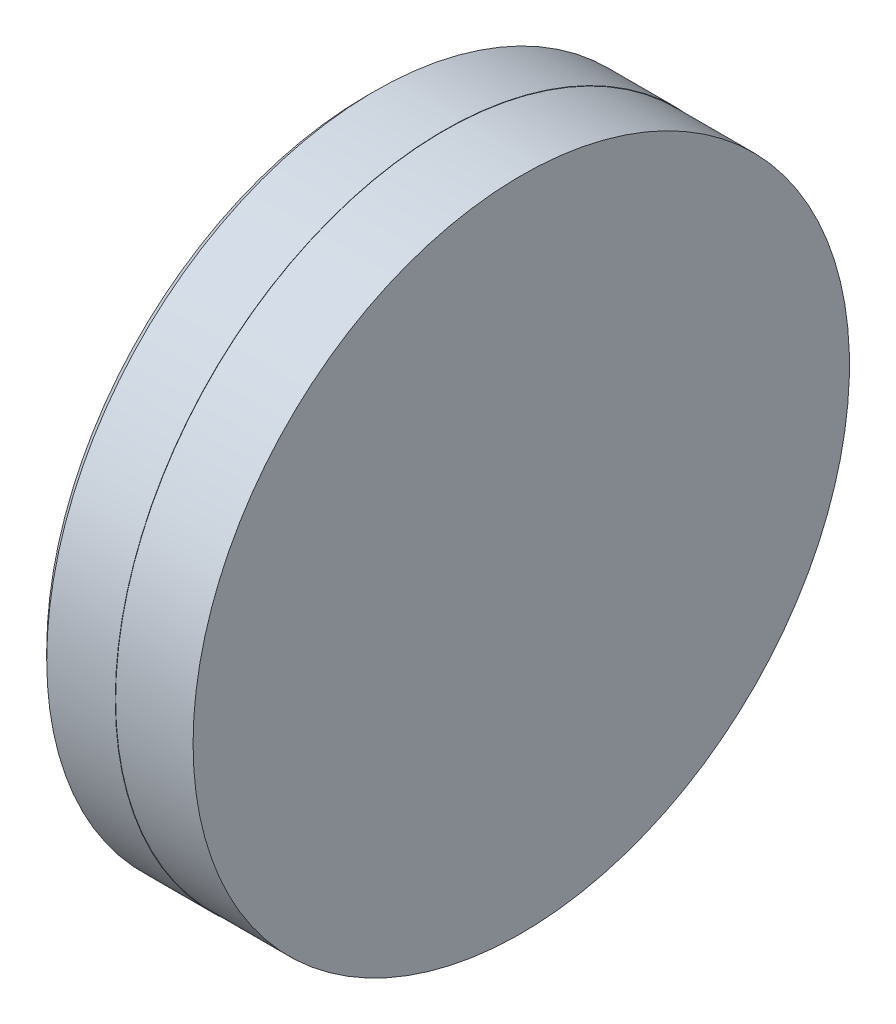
ISO-10303-21;
HEADER;
FILE_DESCRIPTION(('STEP AP214'),'2;1');
FILE_NAME('part.step','',(''),(''),'','','');
FILE_SCHEMA(('AUTOMOTIVE_DESIGN { 1 0 10303 214 1 1 1 1 }'));
ENDSEC;
DATA;
#1=APPLICATION_CONTEXT('core data for automotive mechanical design processes');
#2=APPLICATION_PROTOCOL_DEFINITION('international standard','automotive_design',2000,#1);
#3=PRODUCT_CONTEXT('',#1,'mechanical');
#4=PRODUCT('Part','Part','',(#3));
#5=PRODUCT_RELATED_PRODUCT_CATEGORY('part','',(#4));
#6=PRODUCT_DEFINITION_FORMATION('','',#4);
#7=PRODUCT_DEFINITION_CONTEXT('part definition',#1,'design');
#8=PRODUCT_DEFINITION('design','',#6,#7);
#9=PRODUCT_DEFINITION_SHAPE('','',#8);
#10=(LENGTH_UNIT() NAMED_UNIT(*) SI_UNIT(.MILLI.,.METRE.));
#11=(NAMED_UNIT(*) PLANE_ANGLE_UNIT() SI_UNIT($,.RADIAN.));
#12=(NAMED_UNIT(*) SI_UNIT($,.STERADIAN.) SOLID_ANGLE_UNIT());
#13=UNCERTAINTY_MEASURE_WITH_UNIT(LENGTH_MEASURE(1.E-05),#10,'distance_accuracy_value','');
#14=(GEOMETRIC_REPRESENTATION_CONTEXT(3) GLOBAL_UNCERTAINTY_ASSIGNED_CONTEXT((#13)) GLOBAL_UNIT_ASSIGNED_CONTEXT((#10,
#11,#12)) REPRESENTATION_CONTEXT('',''));
#15=CARTESIAN_POINT('',(0.,0.,0.));
#16=DIRECTION('',(0.,0.,1.));
#17=DIRECTION('',(1.,0.,0.));
#18=AXIS2_PLACEMENT_3D('',#15,#16,#17);
#19=CARTESIAN_POINT('',(-10.2117647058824,0.,0.));
#20=DIRECTION('',(-1.,0.,0.));
#21=DIRECTION('',(0.,1.,0.));
#22=AXIS2_PLACEMENT_3D('',#19,#20,#21);
#23=SPHERICAL_SURFACE('',#22,13.6117647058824);
#24=CARTESIAN_POINT('',(0.,0.,0.));
#25=DIRECTION('',(-1.,0.,0.));
#26=DIRECTION('',(0.,0.,1.));
#27=AXIS2_PLACEMENT_3D('',#24,#25,#26);
#28=CIRCLE('',#27,9.);
#29=CARTESIAN_POINT('',(0.,0.,9.));
#30=VERTEX_POINT('',#29);
#31=EDGE_CURVE('E64',#30,#30,#28,.T.);
#32=ORIENTED_EDGE('',*,*,#31,.T.);
#33=EDGE_LOOP('',(#32));
#34=FACE_BOUND('',#33,.T.);
#35=ADVANCED_FACE('F41',(#34),#23,.F.);
#36=CARTESIAN_POINT('',(4.36000000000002,0.,0.));
#37=DIRECTION('',(1.,0.,0.));
#38=DIRECTION('',(0.,0.,-1.));
#39=AXIS2_PLACEMENT_3D('',#36,#37,#38);
#40=PLANE('',#39);
#41=CARTESIAN_POINT('',(4.36,0.,0.));
#42=DIRECTION('',(-1.,0.,0.));
#43=DIRECTION('',(0.,0.,1.));
#44=AXIS2_PLACEMENT_3D('',#41,#42,#43);
#45=CIRCLE('',#44,9.24);
#46=CARTESIAN_POINT('',(4.36,0.,9.24));
#47=VERTEX_POINT('',#46);
#48=EDGE_CURVE('E10',#47,#47,#45,.T.);
#49=ORIENTED_EDGE('',*,*,#48,.F.);
#50=EDGE_LOOP('',(#49));
#51=FACE_BOUND('',#50,.T.);
#52=ADVANCED_FACE('F87',(#51),#40,.T.);
#53=CARTESIAN_POINT('',(-0.560985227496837,0.,0.));
#54=DIRECTION('',(-1.,0.,0.));
#55=DIRECTION('',(0.,0.,1.));
#56=AXIS2_PLACEMENT_3D('',#53,#54,#55);
#57=CYLINDRICAL_SURFACE('',#56,9.24);
#58=CARTESIAN_POINT('',(2.18,0.,0.));
#59=DIRECTION('',(-1.,0.,0.));
#60=DIRECTION('',(0.,0.,1.));
#61=AXIS2_PLACEMENT_3D('',#58,#59,#60);
#62=CIRCLE('',#61,9.24);
#63=CARTESIAN_POINT('',(2.18,0.,9.24));
#64=VERTEX_POINT('',#63);
#65=EDGE_CURVE('E48',#64,#64,#62,.T.);
#66=ORIENTED_EDGE('',*,*,#65,.F.);
#67=EDGE_LOOP('',(#66));
#68=FACE_BOUND('',#67,.T.);
#69=ORIENTED_EDGE('',*,*,#48,.T.);
#70=EDGE_LOOP('',(#69));
#71=FACE_BOUND('',#70,.T.);
#72=ADVANCED_FACE('F84',(#68,#71),#57,.T.);
#73=CARTESIAN_POINT('',(2.18,0.,0.));
#74=DIRECTION('',(1.,0.,0.));
#75=DIRECTION('',(0.,0.,-1.));
#76=AXIS2_PLACEMENT_3D('',#73,#74,#75);
#77=PLANE('',#76);
#78=ORIENTED_EDGE('',*,*,#65,.T.);
#79=EDGE_LOOP('',(#78));
#80=FACE_BOUND('',#79,.T.);
#81=CARTESIAN_POINT('',(2.18,0.,0.));
#82=DIRECTION('',(-1.,0.,0.));
#83=DIRECTION('',(0.,0.,1.));
#84=AXIS2_PLACEMENT_3D('',#81,#82,#83);
#85=CIRCLE('',#84,9.25);
#86=CARTESIAN_POINT('',(2.18,0.,9.25));
#87=VERTEX_POINT('',#86);
#88=EDGE_CURVE('E53',#87,#87,#85,.T.);
#89=ORIENTED_EDGE('',*,*,#88,.F.);
#90=EDGE_LOOP('',(#89));
#91=FACE_BOUND('',#90,.T.);
#92=ADVANCED_FACE('F78',(#80,#91),#77,.T.);
#93=CARTESIAN_POINT('',(-0.560985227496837,0.,0.));
#94=DIRECTION('',(-1.,0.,0.));
#95=DIRECTION('',(0.,0.,1.));
#96=AXIS2_PLACEMENT_3D('',#93,#94,#95);
#97=CYLINDRICAL_SURFACE('',#96,9.25);
#98=ORIENTED_EDGE('',*,*,#88,.T.);
#99=EDGE_LOOP('',(#98));
#100=FACE_BOUND('',#99,.T.);
#101=CARTESIAN_POINT('',(0.25,0.,0.));
#102=DIRECTION('',(-1.,0.,0.));
#103=DIRECTION('',(0.,0.,1.));
#104=AXIS2_PLACEMENT_3D('',#101,#102,#103);
#105=CIRCLE('',#104,9.25);
#106=CARTESIAN_POINT('',(0.25,0.,9.25));
#107=VERTEX_POINT('',#106);
#108=EDGE_CURVE('E58',#107,#107,#105,.T.);
#109=ORIENTED_EDGE('',*,*,#108,.F.);
#110=EDGE_LOOP('',(#109));
#111=FACE_BOUND('',#110,.T.);
#112=ADVANCED_FACE('F73',(#100,#111),#97,.T.);
#113=CARTESIAN_POINT('',(0.25,0.,0.));
#114=DIRECTION('',(1.,0.,0.));
#115=DIRECTION('',(0.,0.,-1.));
#116=AXIS2_PLACEMENT_3D('',#113,#114,#115);
#117=CONICAL_SURFACE('',#116,9.25,0.785398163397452);
#118=ORIENTED_EDGE('',*,*,#31,.F.);
#119=EDGE_LOOP('',(#118));
#120=FACE_BOUND('',#119,.T.);
#121=ORIENTED_EDGE('',*,*,#108,.T.);
#122=EDGE_LOOP('',(#121));
#123=FACE_BOUND('',#122,.T.);
#124=ADVANCED_FACE('F70',(#120,#123),#117,.T.);
#125=CLOSED_SHELL('',(#35,#52,#72,#92,#112,#124));
#126=MANIFOLD_SOLID_BREP('B2',#125);
#127=ADVANCED_BREP_SHAPE_REPRESENTATION('',(#18,#126),#14);
#128=SHAPE_DEFINITION_REPRESENTATION(#9,#127);
ENDSEC;
END-ISO-10303-21;
